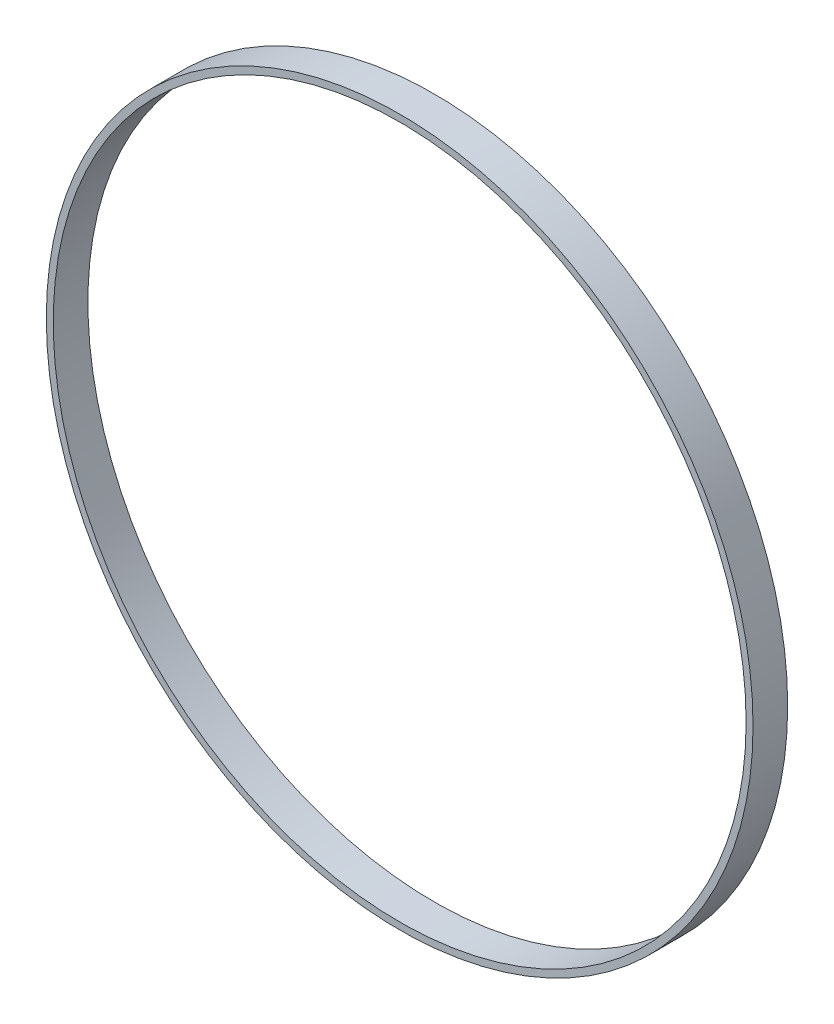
from build123d import *

# Parameters (mm, degrees)
ESQUISSE1_R      = 51
ESQUISSE1_R_2    = 50
EXTRUSION1_DEPTH = 5


with BuildPart() as part:
    # Esquisse1 → Extrusion1 (new body)
    with BuildSketch(Plane.XY):
        Circle(ESQUISSE1_R)
        Circle(ESQUISSE1_R_2, mode=Mode.SUBTRACT)
    extrude(amount=EXTRUSION1_DEPTH)


solid = part.part
